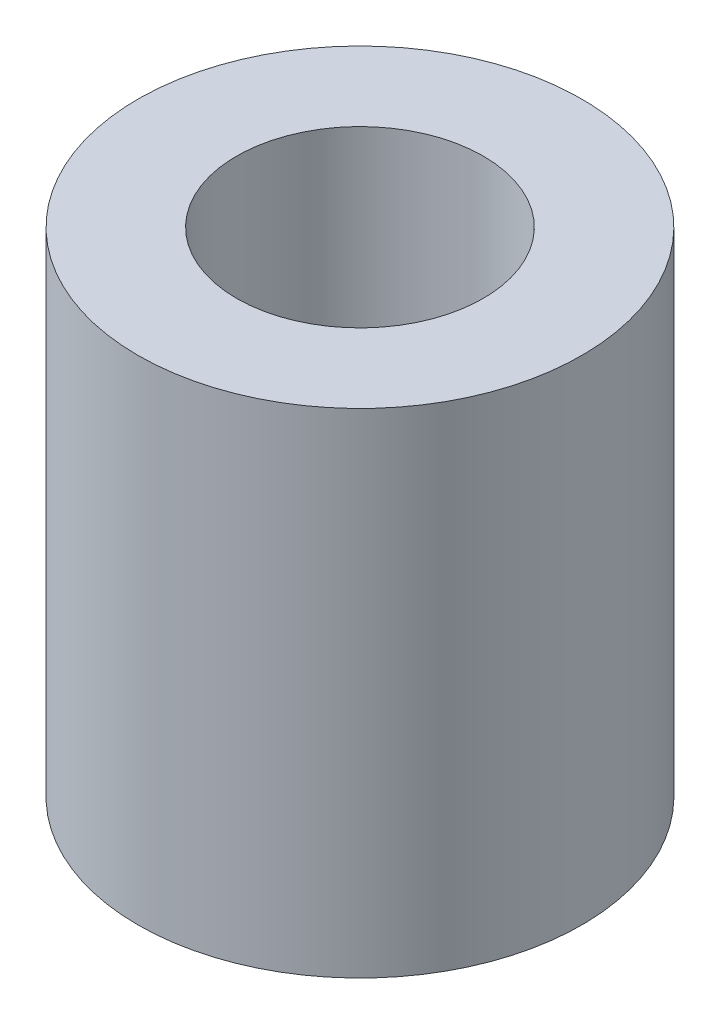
from build123d import *

# Parameters (mm, degrees)
SKETCH1_R           = 4.5
SKETCH1_R_2         = 2.5
BOSS_EXTRUDE1_DEPTH = 5


with BuildPart() as part:
    # Sketch1 → Boss-Extrude1 (new, symmetric)
    with BuildSketch(Plane(origin=(0, 0, 0), x_dir=(1, 0, 0), z_dir=(0, 1, 0))):
        with Locations(Location((0, 0, 0), (0, 0, 270))):
            Circle(SKETCH1_R)
        with Locations(Location((0, 0, 0), (0, 0, 270))):
            Circle(SKETCH1_R_2, mode=Mode.SUBTRACT)
    extrude(amount=BOSS_EXTRUDE1_DEPTH, both=True)


solid = part.part
